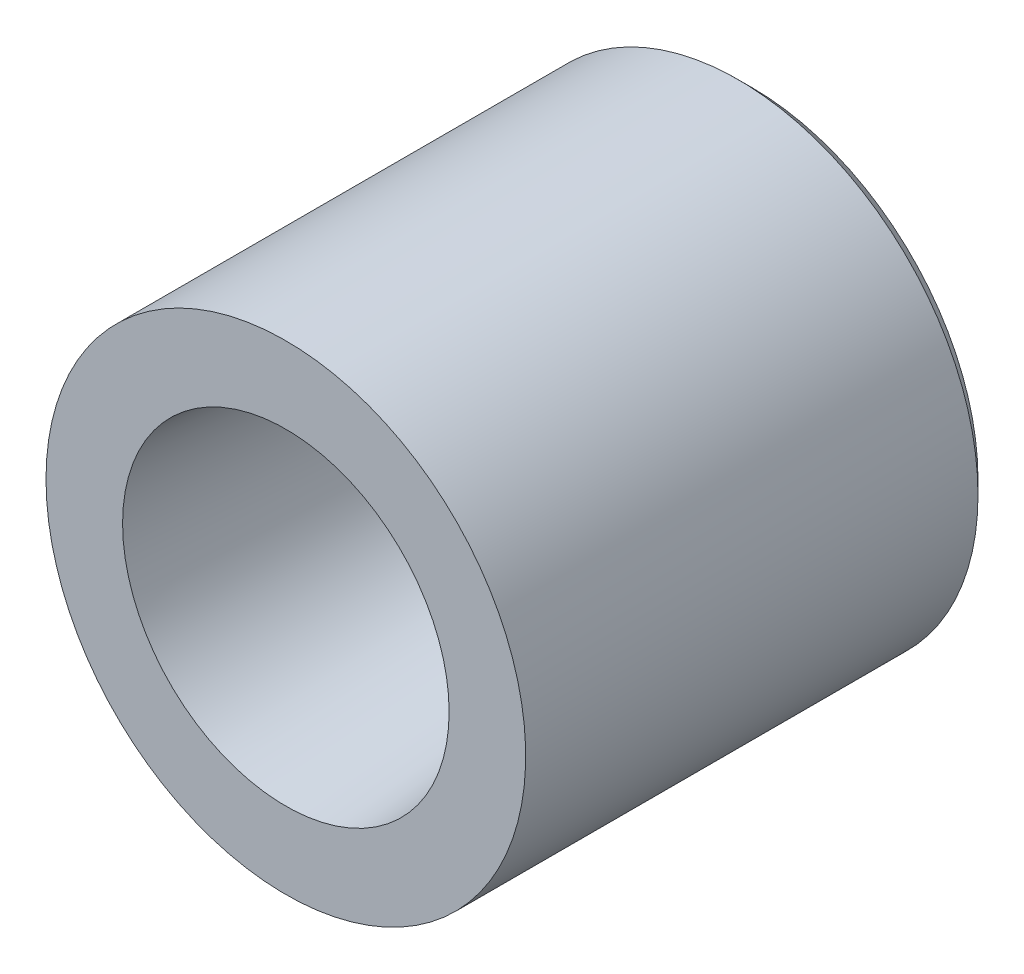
ISO-10303-21;
HEADER;
FILE_DESCRIPTION(('STEP AP214'),'2;1');
FILE_NAME('part.step','',(''),(''),'','','');
FILE_SCHEMA(('AUTOMOTIVE_DESIGN { 1 0 10303 214 1 1 1 1 }'));
ENDSEC;
DATA;
#1=APPLICATION_CONTEXT('core data for automotive mechanical design processes');
#2=APPLICATION_PROTOCOL_DEFINITION('international standard','automotive_design',2000,#1);
#3=PRODUCT_CONTEXT('',#1,'mechanical');
#4=PRODUCT('Part','Part','',(#3));
#5=PRODUCT_RELATED_PRODUCT_CATEGORY('part','',(#4));
#6=PRODUCT_DEFINITION_FORMATION('','',#4);
#7=PRODUCT_DEFINITION_CONTEXT('part definition',#1,'design');
#8=PRODUCT_DEFINITION('design','',#6,#7);
#9=PRODUCT_DEFINITION_SHAPE('','',#8);
#10=(LENGTH_UNIT() NAMED_UNIT(*) SI_UNIT(.MILLI.,.METRE.));
#11=(NAMED_UNIT(*) PLANE_ANGLE_UNIT() SI_UNIT($,.RADIAN.));
#12=(NAMED_UNIT(*) SI_UNIT($,.STERADIAN.) SOLID_ANGLE_UNIT());
#13=UNCERTAINTY_MEASURE_WITH_UNIT(LENGTH_MEASURE(1.E-05),#10,'distance_accuracy_value','');
#14=(GEOMETRIC_REPRESENTATION_CONTEXT(3) GLOBAL_UNCERTAINTY_ASSIGNED_CONTEXT((#13)) GLOBAL_UNIT_ASSIGNED_CONTEXT((#10,
#11,#12)) REPRESENTATION_CONTEXT('',''));
#15=CARTESIAN_POINT('',(0.,0.,0.));
#16=DIRECTION('',(0.,0.,1.));
#17=DIRECTION('',(1.,0.,0.));
#18=AXIS2_PLACEMENT_3D('',#15,#16,#17);
#19=CARTESIAN_POINT('',(-1.09504998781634E-13,0.,-15.6817390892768));
#20=DIRECTION('',(0.,0.,1.));
#21=DIRECTION('',(1.,0.,0.));
#22=AXIS2_PLACEMENT_3D('',#19,#20,#21);
#23=CONICAL_SURFACE('',#22,14.7434649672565,0.785398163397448);
#24=CARTESIAN_POINT('',(-1.46642216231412E-13,0.,-21.));
#25=DIRECTION('',(0.,0.,1.));
#26=DIRECTION('',(-1.,0.,0.));
#27=AXIS2_PLACEMENT_3D('',#24,#25,#26);
#28=CIRCLE('',#27,9.42520405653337);
#29=CARTESIAN_POINT('',(9.42520405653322,0.,-21.));
#30=VERTEX_POINT('',#29);
#31=CARTESIAN_POINT('',(-9.42520405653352,0.,-21.));
#32=VERTEX_POINT('',#31);
#33=EDGE_CURVE('E143',#30,#32,#28,.T.);
#34=ORIENTED_EDGE('',*,*,#33,.F.);
#35=CARTESIAN_POINT('',(9.42520417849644,0.,-20.9999998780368));
#36=CARTESIAN_POINT('',(10.4252038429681,0.,-20.0000002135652));
#37=B_SPLINE_CURVE_WITH_KNOTS('',1,(#35,#36),.UNSPECIFIED.,.F.,.F.,(2,2),(0.639280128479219,
0.707106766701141),.UNSPECIFIED.);
#38=CARTESIAN_POINT('',(10.4252040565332,0.,-20.));
#39=VERTEX_POINT('',#38);
#40=EDGE_CURVE('E44',#30,#39,#37,.T.);
#41=ORIENTED_EDGE('',*,*,#40,.T.);
#42=CARTESIAN_POINT('',(-1.39659253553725E-13,0.,-20.));
#43=DIRECTION('',(0.,0.,-1.));
#44=DIRECTION('',(-1.,0.,0.));
#45=AXIS2_PLACEMENT_3D('',#42,#43,#44);
#46=CIRCLE('',#45,10.4252040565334);
#47=CARTESIAN_POINT('',(-10.4252040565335,0.,-20.));
#48=VERTEX_POINT('',#47);
#49=EDGE_CURVE('E11',#48,#39,#46,.T.);
#50=ORIENTED_EDGE('',*,*,#49,.F.);
#51=CARTESIAN_POINT('',(-1.39659253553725E-13,0.,-20.));
#52=DIRECTION('',(0.,0.,-1.));
#53=DIRECTION('',(-1.,0.,0.));
#54=AXIS2_PLACEMENT_3D('',#51,#52,#53);
#55=CIRCLE('',#54,10.4252040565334);
#56=EDGE_CURVE('E51',#39,#48,#55,.T.);
#57=ORIENTED_EDGE('',*,*,#56,.F.);
#58=ORIENTED_EDGE('',*,*,#40,.F.);
#59=CARTESIAN_POINT('',(-1.46642216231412E-13,0.,-21.));
#60=DIRECTION('',(0.,0.,1.));
#61=DIRECTION('',(-1.,0.,0.));
#62=AXIS2_PLACEMENT_3D('',#59,#60,#61);
#63=CIRCLE('',#62,9.42520405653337);
#64=EDGE_CURVE('E59',#32,#30,#63,.T.);
#65=ORIENTED_EDGE('',*,*,#64,.F.);
#66=EDGE_LOOP('',(#34,#41,#50,#57,#58,#65));
#67=FACE_BOUND('',#66,.T.);
#68=ADVANCED_FACE('F36',(#67),#23,.F.);
#69=CARTESIAN_POINT('',(-1.36167772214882E-13,0.,-19.5));
#70=DIRECTION('',(0.,0.,-1.));
#71=DIRECTION('',(-1.,0.,0.));
#72=AXIS2_PLACEMENT_3D('',#69,#70,#71);
#73=CYLINDRICAL_SURFACE('',#72,10.4252040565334);
#74=CARTESIAN_POINT('',(-1.25693328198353E-13,0.,-18.));
#75=DIRECTION('',(0.,0.,-1.));
#76=DIRECTION('',(-1.,0.,0.));
#77=AXIS2_PLACEMENT_3D('',#74,#75,#76);
#78=CIRCLE('',#77,10.4252040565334);
#79=CARTESIAN_POINT('',(-10.4252040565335,0.,-18.));
#80=VERTEX_POINT('',#79);
#81=EDGE_CURVE('E152',#80,#80,#78,.T.);
#82=ORIENTED_EDGE('',*,*,#81,.F.);
#83=CARTESIAN_POINT('',(-10.4252040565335,0.,-17.9999969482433));
#84=CARTESIAN_POINT('',(-10.4252040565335,0.,-20.0000020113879));
#85=B_SPLINE_CURVE_WITH_KNOTS('',1,(#83,#84),.UNSPECIFIED.,.F.,.F.,(2,2),(0.0833320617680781,
0.91666750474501),.UNSPECIFIED.);
#86=EDGE_CURVE('E147',#80,#48,#85,.T.);
#87=ORIENTED_EDGE('',*,*,#86,.T.);
#88=ORIENTED_EDGE('',*,*,#49,.T.);
#89=ORIENTED_EDGE('',*,*,#56,.T.);
#90=ORIENTED_EDGE('',*,*,#86,.F.);
#91=EDGE_LOOP('',(#82,#87,#88,#89,#90));
#92=FACE_BOUND('',#91,.T.);
#93=ADVANCED_FACE('F191',(#92),#73,.F.);
#94=CARTESIAN_POINT('',(21.6779693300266,-19.5899187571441,-21.));
#95=DIRECTION('',(0.,0.,-1.));
#96=DIRECTION('',(-1.,0.,0.));
#97=AXIS2_PLACEMENT_3D('',#94,#95,#96);
#98=PLANE('',#97);
#99=CARTESIAN_POINT('',(-2.44403693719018E-13,0.,-20.9999999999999));
#100=DIRECTION('',(0.,0.,-1.));
#101=DIRECTION('',(-1.,0.,0.));
#102=AXIS2_PLACEMENT_3D('',#99,#100,#101);
#103=CIRCLE('',#102,5.09999999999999);
#104=CARTESIAN_POINT('',(-5.10000000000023,0.,-20.9999999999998));
#105=VERTEX_POINT('',#104);
#106=EDGE_CURVE('E103',#105,#105,#103,.T.);
#107=ORIENTED_EDGE('',*,*,#106,.T.);
#108=EDGE_LOOP('',(#107));
#109=FACE_BOUND('',#108,.T.);
#110=ORIENTED_EDGE('',*,*,#64,.T.);
#111=ORIENTED_EDGE('',*,*,#33,.T.);
#112=EDGE_LOOP('',(#110,#111));
#113=FACE_BOUND('',#112,.T.);
#114=ADVANCED_FACE('F193',(#109,#113),#98,.F.);
#115=CARTESIAN_POINT('',(0.,0.,-1.));
#116=DIRECTION('',(0.,0.,1.));
#117=DIRECTION('',(-1.,0.,0.));
#118=AXIS2_PLACEMENT_3D('',#115,#116,#117);
#119=CONICAL_SURFACE('',#118,11.9125113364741,0.0872664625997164);
#120=ORIENTED_EDGE('',*,*,#81,.T.);
#121=CARTESIAN_POINT('',(-10.4252040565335,0.,-18.));
#122=CARTESIAN_POINT('',(-11.9125113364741,0.,-0.999999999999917));
#123=B_SPLINE_CURVE_WITH_KNOTS('',1,(#121,#122),.UNSPECIFIED.,.F.,.F.,(2,2),(0.,1.),.UNSPECIFIED.);
#124=CARTESIAN_POINT('',(-11.9125113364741,0.,-0.999999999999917));
#125=VERTEX_POINT('',#124);
#126=EDGE_CURVE('E108',#80,#125,#123,.T.);
#127=ORIENTED_EDGE('',*,*,#126,.T.);
#128=CARTESIAN_POINT('',(0.,0.,-1.));
#129=DIRECTION('',(0.,0.,-1.));
#130=DIRECTION('',(1.,0.,0.));
#131=AXIS2_PLACEMENT_3D('',#128,#129,#130);
#132=CIRCLE('',#131,11.9125113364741);
#133=CARTESIAN_POINT('',(11.9125113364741,0.,-1.00000000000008));
#134=VERTEX_POINT('',#133);
#135=EDGE_CURVE('E133',#134,#125,#132,.T.);
#136=ORIENTED_EDGE('',*,*,#135,.F.);
#137=CARTESIAN_POINT('',(0.,0.,-1.));
#138=DIRECTION('',(0.,0.,-1.));
#139=DIRECTION('',(1.,0.,0.));
#140=AXIS2_PLACEMENT_3D('',#137,#138,#139);
#141=CIRCLE('',#140,11.9125113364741);
#142=EDGE_CURVE('E126',#125,#134,#141,.T.);
#143=ORIENTED_EDGE('',*,*,#142,.F.);
#144=ORIENTED_EDGE('',*,*,#126,.F.);
#145=EDGE_LOOP('',(#120,#127,#136,#143,#144));
#146=FACE_BOUND('',#145,.T.);
#147=ADVANCED_FACE('F189',(#146),#119,.F.);
#148=CARTESIAN_POINT('',(-1.86803068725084E-13,0.,-26.7512626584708));
#149=DIRECTION('',(0.,0.,1.));
#150=DIRECTION('',(1.,0.,0.));
#151=AXIS2_PLACEMENT_3D('',#148,#149,#150);
#152=CONICAL_SURFACE('',#151,24.7487373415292,0.785398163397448);
#153=CARTESIAN_POINT('',(-2.4440369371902E-13,0.,-35.));
#154=DIRECTION('',(0.,0.,1.));
#155=DIRECTION('',(-1.,0.,0.));
#156=AXIS2_PLACEMENT_3D('',#153,#154,#155);
#157=CIRCLE('',#156,16.5);
#158=CARTESIAN_POINT('',(-16.5000000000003,0.,-35.));
#159=VERTEX_POINT('',#158);
#160=CARTESIAN_POINT('',(16.4999999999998,0.,-35.));
#161=VERTEX_POINT('',#160);
#162=EDGE_CURVE('E90',#159,#161,#157,.T.);
#163=ORIENTED_EDGE('',*,*,#162,.T.);
#164=CARTESIAN_POINT('',(16.4999992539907,0.,-35.0000007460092));
#165=CARTESIAN_POINT('',(17.4999995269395,0.,-34.0000004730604));
#166=B_SPLINE_CURVE_WITH_KNOTS('',1,(#164,#165),.UNSPECIFIED.,.F.,.F.,(2,2),(0.666700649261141,
0.707106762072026),.UNSPECIFIED.);
#167=CARTESIAN_POINT('',(17.4999999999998,0.,-34.));
#168=VERTEX_POINT('',#167);
#169=EDGE_CURVE('E95',#161,#168,#166,.T.);
#170=ORIENTED_EDGE('',*,*,#169,.T.);
#171=CARTESIAN_POINT('',(-2.37420731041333E-13,0.,-34.));
#172=DIRECTION('',(0.,0.,-1.));
#173=DIRECTION('',(-1.,0.,0.));
#174=AXIS2_PLACEMENT_3D('',#171,#172,#173);
#175=CIRCLE('',#174,17.5);
#176=CARTESIAN_POINT('',(-17.5000000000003,0.,-34.));
#177=VERTEX_POINT('',#176);
#178=EDGE_CURVE('E102',#168,#177,#175,.T.);
#179=ORIENTED_EDGE('',*,*,#178,.T.);
#180=CARTESIAN_POINT('',(-2.37420731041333E-13,0.,-34.));
#181=DIRECTION('',(0.,0.,-1.));
#182=DIRECTION('',(-1.,0.,0.));
#183=AXIS2_PLACEMENT_3D('',#180,#181,#182);
#184=CIRCLE('',#183,17.5);
#185=EDGE_CURVE('E105',#177,#168,#184,.T.);
#186=ORIENTED_EDGE('',*,*,#185,.T.);
#187=ORIENTED_EDGE('',*,*,#169,.F.);
#188=CARTESIAN_POINT('',(-2.4440369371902E-13,0.,-35.));
#189=DIRECTION('',(0.,0.,1.));
#190=DIRECTION('',(-1.,0.,0.));
#191=AXIS2_PLACEMENT_3D('',#188,#189,#190);
#192=CIRCLE('',#191,16.5);
#193=EDGE_CURVE('E97',#161,#159,#192,.T.);
#194=ORIENTED_EDGE('',*,*,#193,.T.);
#195=EDGE_LOOP('',(#163,#170,#179,#186,#187,#194));
#196=FACE_BOUND('',#195,.T.);
#197=ADVANCED_FACE('F92',(#196),#152,.T.);
#198=CARTESIAN_POINT('',(-1.25693328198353E-13,0.,-18.));
#199=DIRECTION('',(0.,0.,-1.));
#200=DIRECTION('',(-1.,0.,0.));
#201=AXIS2_PLACEMENT_3D('',#198,#199,#200);
#202=CYLINDRICAL_SURFACE('',#201,17.5);
#203=CARTESIAN_POINT('',(0.,0.,-1.));
#204=DIRECTION('',(0.,0.,1.));
#205=DIRECTION('',(-1.,0.,0.));
#206=AXIS2_PLACEMENT_3D('',#203,#204,#205);
#207=CIRCLE('',#206,17.5);
#208=CARTESIAN_POINT('',(-17.5,0.,-0.999999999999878));
#209=VERTEX_POINT('',#208);
#210=EDGE_CURVE('E99',#209,#209,#207,.T.);
#211=ORIENTED_EDGE('',*,*,#210,.F.);
#212=CARTESIAN_POINT('',(-17.5,0.,-0.999998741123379));
#213=CARTESIAN_POINT('',(-17.5000000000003,0.,-33.9999995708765));
#214=B_SPLINE_CURVE_WITH_KNOTS('',1,(#212,#213),.UNSPECIFIED.,.F.,.F.,(2,2),(0.0833333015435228,
0.916666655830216),.UNSPECIFIED.);
#215=EDGE_CURVE('E173',#209,#177,#214,.T.);
#216=ORIENTED_EDGE('',*,*,#215,.T.);
#217=ORIENTED_EDGE('',*,*,#178,.F.);
#218=ORIENTED_EDGE('',*,*,#185,.F.);
#219=ORIENTED_EDGE('',*,*,#215,.F.);
#220=EDGE_LOOP('',(#211,#216,#217,#218,#219));
#221=FACE_BOUND('',#220,.T.);
#222=ADVANCED_FACE('F225',(#221),#202,.T.);
#223=CARTESIAN_POINT('',(37.95,-34.2946059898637,-35.));
#224=DIRECTION('',(0.,0.,-1.));
#225=DIRECTION('',(-1.,0.,0.));
#226=AXIS2_PLACEMENT_3D('',#223,#224,#225);
#227=PLANE('',#226);
#228=CARTESIAN_POINT('',(-2.44403693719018E-13,0.,-34.9999999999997));
#229=DIRECTION('',(0.,0.,-1.));
#230=DIRECTION('',(-1.,0.,0.));
#231=AXIS2_PLACEMENT_3D('',#228,#229,#230);
#232=CIRCLE('',#231,5.09999999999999);
#233=CARTESIAN_POINT('',(-5.10000000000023,0.,-34.9999999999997));
#234=VERTEX_POINT('',#233);
#235=EDGE_CURVE('E275',#234,#234,#232,.T.);
#236=ORIENTED_EDGE('',*,*,#235,.F.);
#237=EDGE_LOOP('',(#236));
#238=FACE_BOUND('',#237,.T.);
#239=ORIENTED_EDGE('',*,*,#193,.F.);
#240=ORIENTED_EDGE('',*,*,#162,.F.);
#241=EDGE_LOOP('',(#239,#240));
#242=FACE_BOUND('',#241,.T.);
#243=ADVANCED_FACE('F101',(#238,#242),#227,.T.);
#244=CARTESIAN_POINT('',(-22.75,-36.3730669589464,-0.999999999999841));
#245=DIRECTION('',(0.,0.,1.));
#246=DIRECTION('',(1.,0.,0.));
#247=AXIS2_PLACEMENT_3D('',#244,#245,#246);
#248=PLANE('',#247);
#249=ORIENTED_EDGE('',*,*,#210,.T.);
#250=EDGE_LOOP('',(#249));
#251=FACE_BOUND('',#250,.T.);
#252=ORIENTED_EDGE('',*,*,#135,.T.);
#253=ORIENTED_EDGE('',*,*,#142,.T.);
#254=EDGE_LOOP('',(#252,#253));
#255=FACE_BOUND('',#254,.T.);
#256=ADVANCED_FACE('F240',(#251,#255),#248,.T.);
#257=CARTESIAN_POINT('',(-2.44403693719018E-13,0.,-34.9999999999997));
#258=DIRECTION('',(0.,0.,-1.));
#259=DIRECTION('',(-1.,0.,0.));
#260=AXIS2_PLACEMENT_3D('',#257,#258,#259);
#261=CYLINDRICAL_SURFACE('',#260,5.09999999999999);
#262=ORIENTED_EDGE('',*,*,#235,.T.);
#263=EDGE_LOOP('',(#262));
#264=FACE_BOUND('',#263,.T.);
#265=ORIENTED_EDGE('',*,*,#106,.F.);
#266=EDGE_LOOP('',(#265));
#267=FACE_BOUND('',#266,.T.);
#268=ADVANCED_FACE('F248',(#264,#267),#261,.F.);
#269=CLOSED_SHELL('',(#68,#93,#114,#147,#197,#222,#243,#256,#268));
#270=MANIFOLD_SOLID_BREP('B2',#269);
#271=ADVANCED_BREP_SHAPE_REPRESENTATION('',(#18,#270),#14);
#272=SHAPE_DEFINITION_REPRESENTATION(#9,#271);
ENDSEC;
END-ISO-10303-21;
